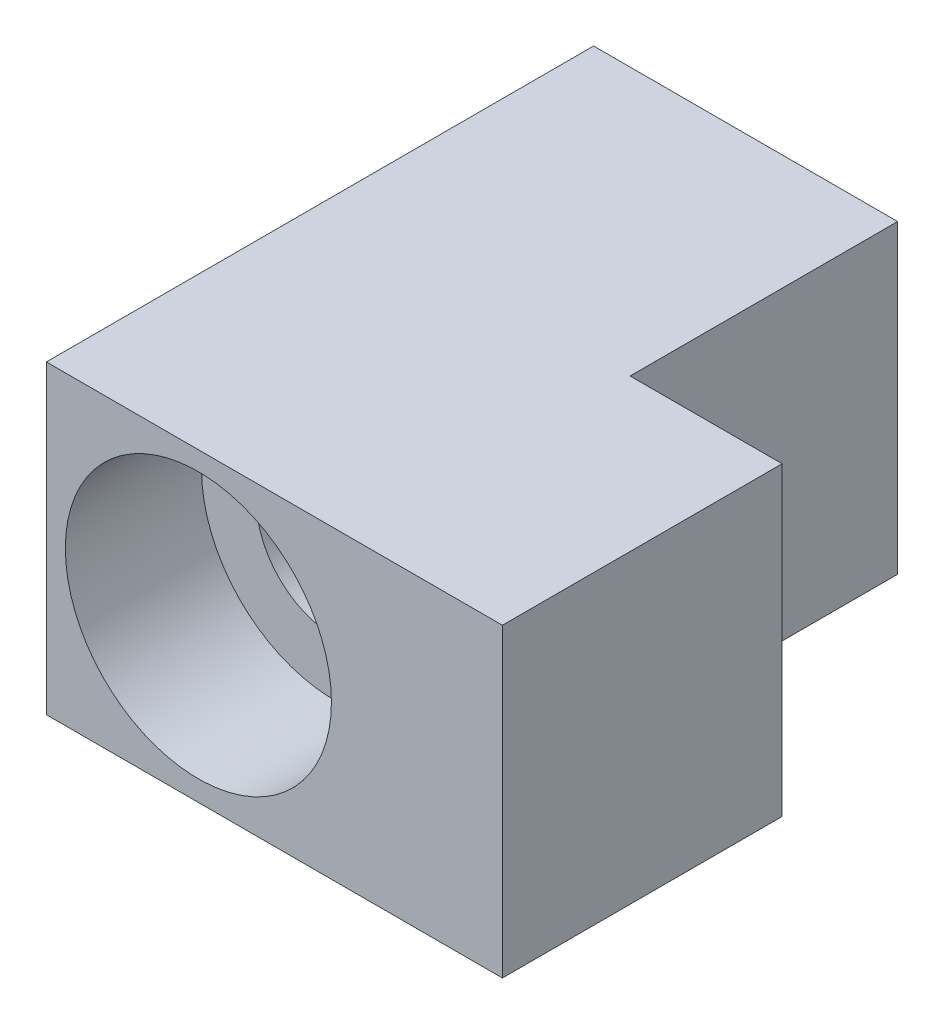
ISO-10303-21;
HEADER;
FILE_DESCRIPTION(('STEP AP214'),'2;1');
FILE_NAME('part.step','',(''),(''),'','','');
FILE_SCHEMA(('AUTOMOTIVE_DESIGN { 1 0 10303 214 1 1 1 1 }'));
ENDSEC;
DATA;
#1=APPLICATION_CONTEXT('core data for automotive mechanical design processes');
#2=APPLICATION_PROTOCOL_DEFINITION('international standard','automotive_design',2000,#1);
#3=PRODUCT_CONTEXT('',#1,'mechanical');
#4=PRODUCT('Part','Part','',(#3));
#5=PRODUCT_RELATED_PRODUCT_CATEGORY('part','',(#4));
#6=PRODUCT_DEFINITION_FORMATION('','',#4);
#7=PRODUCT_DEFINITION_CONTEXT('part definition',#1,'design');
#8=PRODUCT_DEFINITION('design','',#6,#7);
#9=PRODUCT_DEFINITION_SHAPE('','',#8);
#10=(LENGTH_UNIT() NAMED_UNIT(*) SI_UNIT(.MILLI.,.METRE.));
#11=(NAMED_UNIT(*) PLANE_ANGLE_UNIT() SI_UNIT($,.RADIAN.));
#12=(NAMED_UNIT(*) SI_UNIT($,.STERADIAN.) SOLID_ANGLE_UNIT());
#13=UNCERTAINTY_MEASURE_WITH_UNIT(LENGTH_MEASURE(1.E-05),#10,'distance_accuracy_value','');
#14=(GEOMETRIC_REPRESENTATION_CONTEXT(3) GLOBAL_UNCERTAINTY_ASSIGNED_CONTEXT((#13)) GLOBAL_UNIT_ASSIGNED_CONTEXT((#10,
#11,#12)) REPRESENTATION_CONTEXT('',''));
#15=CARTESIAN_POINT('',(0.,0.,0.));
#16=DIRECTION('',(0.,0.,1.));
#17=DIRECTION('',(1.,0.,0.));
#18=AXIS2_PLACEMENT_3D('',#15,#16,#17);
#19=CARTESIAN_POINT('',(6.35,0.,11.43));
#20=DIRECTION('',(-1.,0.,0.));
#21=DIRECTION('',(0.,0.,1.));
#22=AXIS2_PLACEMENT_3D('',#19,#20,#21);
#23=PLANE('',#22);
#24=DIRECTION('',(0.,1.,0.));
#25=VECTOR('',#24,1.);
#26=CARTESIAN_POINT('',(6.35,6.38112745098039,5.588));
#27=LINE('',#26,#25);
#28=CARTESIAN_POINT('',(6.35,0.,5.588));
#29=VERTEX_POINT('',#28);
#30=CARTESIAN_POINT('',(6.35,6.38112745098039,5.588));
#31=VERTEX_POINT('',#30);
#32=EDGE_CURVE('E51',#29,#31,#27,.T.);
#33=ORIENTED_EDGE('',*,*,#32,.F.);
#34=DIRECTION('',(0.,0.,-1.));
#35=VECTOR('',#34,1.);
#36=CARTESIAN_POINT('',(6.35,0.,11.43));
#37=LINE('',#36,#35);
#38=CARTESIAN_POINT('',(6.35,0.,0.));
#39=VERTEX_POINT('',#38);
#40=EDGE_CURVE('E43',#29,#39,#37,.T.);
#41=ORIENTED_EDGE('',*,*,#40,.T.);
#42=DIRECTION('',(0.,1.,0.));
#43=VECTOR('',#42,1.);
#44=CARTESIAN_POINT('',(6.35,0.,0.));
#45=LINE('',#44,#43);
#46=CARTESIAN_POINT('',(6.35,6.38112745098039,0.));
#47=VERTEX_POINT('',#46);
#48=EDGE_CURVE('E90',#39,#47,#45,.T.);
#49=ORIENTED_EDGE('',*,*,#48,.T.);
#50=DIRECTION('',(0.,0.,-1.));
#51=VECTOR('',#50,1.);
#52=CARTESIAN_POINT('',(6.35,6.38112745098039,11.43));
#53=LINE('',#52,#51);
#54=EDGE_CURVE('E84',#31,#47,#53,.T.);
#55=ORIENTED_EDGE('',*,*,#54,.F.);
#56=EDGE_LOOP('',(#33,#41,#49,#55));
#57=FACE_BOUND('',#56,.T.);
#58=ADVANCED_FACE('F34',(#57),#23,.F.);
#59=CARTESIAN_POINT('',(0.,0.,11.43));
#60=DIRECTION('',(1.,0.,0.));
#61=DIRECTION('',(0.,0.,-1.));
#62=AXIS2_PLACEMENT_3D('',#59,#60,#61);
#63=PLANE('',#62);
#64=DIRECTION('',(0.,-1.,0.));
#65=VECTOR('',#64,1.);
#66=CARTESIAN_POINT('',(0.,0.,0.));
#67=LINE('',#66,#65);
#68=CARTESIAN_POINT('',(0.,6.38112745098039,0.));
#69=VERTEX_POINT('',#68);
#70=CARTESIAN_POINT('',(0.,0.,0.));
#71=VERTEX_POINT('',#70);
#72=EDGE_CURVE('E95',#69,#71,#67,.T.);
#73=ORIENTED_EDGE('',*,*,#72,.T.);
#74=DIRECTION('',(0.,0.,-1.));
#75=VECTOR('',#74,1.);
#76=CARTESIAN_POINT('',(0.,0.,11.43));
#77=LINE('',#76,#75);
#78=CARTESIAN_POINT('',(0.,0.,11.43));
#79=VERTEX_POINT('',#78);
#80=EDGE_CURVE('E11',#79,#71,#77,.T.);
#81=ORIENTED_EDGE('',*,*,#80,.F.);
#82=DIRECTION('',(0.,-1.,0.));
#83=VECTOR('',#82,1.);
#84=CARTESIAN_POINT('',(0.,0.,11.43));
#85=LINE('',#84,#83);
#86=CARTESIAN_POINT('',(0.,6.38112745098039,11.43));
#87=VERTEX_POINT('',#86);
#88=EDGE_CURVE('E89',#87,#79,#85,.T.);
#89=ORIENTED_EDGE('',*,*,#88,.F.);
#90=DIRECTION('',(0.,0.,-1.));
#91=VECTOR('',#90,1.);
#92=CARTESIAN_POINT('',(0.,6.38112745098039,11.43));
#93=LINE('',#92,#91);
#94=EDGE_CURVE('E81',#87,#69,#93,.T.);
#95=ORIENTED_EDGE('',*,*,#94,.T.);
#96=EDGE_LOOP('',(#73,#81,#89,#95));
#97=FACE_BOUND('',#96,.T.);
#98=ADVANCED_FACE('F36',(#97),#63,.F.);
#99=CARTESIAN_POINT('',(0.,0.,11.43));
#100=DIRECTION('',(0.,1.,0.));
#101=DIRECTION('',(0.,0.,1.));
#102=AXIS2_PLACEMENT_3D('',#99,#100,#101);
#103=PLANE('',#102);
#104=DIRECTION('',(1.,0.,0.));
#105=VECTOR('',#104,1.);
#106=CARTESIAN_POINT('',(0.,0.,0.));
#107=LINE('',#106,#105);
#108=EDGE_CURVE('E99',#71,#39,#107,.T.);
#109=ORIENTED_EDGE('',*,*,#108,.T.);
#110=ORIENTED_EDGE('',*,*,#40,.F.);
#111=DIRECTION('',(-1.,0.,0.));
#112=VECTOR('',#111,1.);
#113=CARTESIAN_POINT('',(9.525,0.,5.588));
#114=LINE('',#113,#112);
#115=CARTESIAN_POINT('',(9.525,0.,5.588));
#116=VERTEX_POINT('',#115);
#117=EDGE_CURVE('E100',#116,#29,#114,.T.);
#118=ORIENTED_EDGE('',*,*,#117,.F.);
#119=DIRECTION('',(0.,0.,-1.));
#120=VECTOR('',#119,1.);
#121=CARTESIAN_POINT('',(9.525,0.,11.43));
#122=LINE('',#121,#120);
#123=CARTESIAN_POINT('',(9.525,0.,11.43));
#124=VERTEX_POINT('',#123);
#125=EDGE_CURVE('E137',#124,#116,#122,.T.);
#126=ORIENTED_EDGE('',*,*,#125,.F.);
#127=DIRECTION('',(1.,0.,0.));
#128=VECTOR('',#127,1.);
#129=CARTESIAN_POINT('',(0.,0.,11.43));
#130=LINE('',#129,#128);
#131=EDGE_CURVE('E125',#79,#124,#130,.T.);
#132=ORIENTED_EDGE('',*,*,#131,.F.);
#133=ORIENTED_EDGE('',*,*,#80,.T.);
#134=EDGE_LOOP('',(#109,#110,#118,#126,#132,#133));
#135=FACE_BOUND('',#134,.T.);
#136=ADVANCED_FACE('F138',(#135),#103,.F.);
#137=CARTESIAN_POINT('',(0.,6.38112745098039,11.43));
#138=DIRECTION('',(0.,-1.,0.));
#139=DIRECTION('',(0.,0.,-1.));
#140=AXIS2_PLACEMENT_3D('',#137,#138,#139);
#141=PLANE('',#140);
#142=DIRECTION('',(-1.,0.,0.));
#143=VECTOR('',#142,1.);
#144=CARTESIAN_POINT('',(0.,6.38112745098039,0.));
#145=LINE('',#144,#143);
#146=EDGE_CURVE('E78',#47,#69,#145,.T.);
#147=ORIENTED_EDGE('',*,*,#146,.T.);
#148=ORIENTED_EDGE('',*,*,#94,.F.);
#149=DIRECTION('',(-1.,0.,0.));
#150=VECTOR('',#149,1.);
#151=CARTESIAN_POINT('',(0.,6.38112745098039,11.43));
#152=LINE('',#151,#150);
#153=CARTESIAN_POINT('',(9.525,6.38112745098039,11.43));
#154=VERTEX_POINT('',#153);
#155=EDGE_CURVE('E60',#154,#87,#152,.T.);
#156=ORIENTED_EDGE('',*,*,#155,.F.);
#157=DIRECTION('',(0.,0.,1.));
#158=VECTOR('',#157,1.);
#159=CARTESIAN_POINT('',(9.525,6.38112745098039,11.43));
#160=LINE('',#159,#158);
#161=CARTESIAN_POINT('',(9.525,6.38112745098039,5.588));
#162=VERTEX_POINT('',#161);
#163=EDGE_CURVE('E123',#162,#154,#160,.T.);
#164=ORIENTED_EDGE('',*,*,#163,.F.);
#165=DIRECTION('',(-1.,0.,0.));
#166=VECTOR('',#165,1.);
#167=CARTESIAN_POINT('',(9.525,6.38112745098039,5.588));
#168=LINE('',#167,#166);
#169=EDGE_CURVE('E104',#162,#31,#168,.T.);
#170=ORIENTED_EDGE('',*,*,#169,.T.);
#171=ORIENTED_EDGE('',*,*,#54,.T.);
#172=EDGE_LOOP('',(#147,#148,#156,#164,#170,#171));
#173=FACE_BOUND('',#172,.T.);
#174=ADVANCED_FACE('F80',(#173),#141,.F.);
#175=CARTESIAN_POINT('',(0.,0.,11.43));
#176=DIRECTION('',(0.,0.,-1.));
#177=DIRECTION('',(-1.,0.,0.));
#178=AXIS2_PLACEMENT_3D('',#175,#176,#177);
#179=PLANE('',#178);
#180=CARTESIAN_POINT('',(3.175,3.20612745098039,11.43));
#181=DIRECTION('',(0.,0.,1.));
#182=DIRECTION('',(1.,0.,0.));
#183=AXIS2_PLACEMENT_3D('',#180,#181,#182);
#184=CIRCLE('',#183,2.77875999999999);
#185=CARTESIAN_POINT('',(5.95375999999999,3.20612745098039,11.43));
#186=VERTEX_POINT('',#185);
#187=EDGE_CURVE('E187',#186,#186,#184,.T.);
#188=ORIENTED_EDGE('',*,*,#187,.F.);
#189=EDGE_LOOP('',(#188));
#190=FACE_BOUND('',#189,.T.);
#191=ORIENTED_EDGE('',*,*,#88,.T.);
#192=ORIENTED_EDGE('',*,*,#131,.T.);
#193=DIRECTION('',(0.,-1.,0.));
#194=VECTOR('',#193,1.);
#195=CARTESIAN_POINT('',(9.525,6.38112745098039,11.43));
#196=LINE('',#195,#194);
#197=EDGE_CURVE('E118',#154,#124,#196,.T.);
#198=ORIENTED_EDGE('',*,*,#197,.F.);
#199=ORIENTED_EDGE('',*,*,#155,.T.);
#200=EDGE_LOOP('',(#191,#192,#198,#199));
#201=FACE_BOUND('',#200,.T.);
#202=ADVANCED_FACE('F129',(#190,#201),#179,.F.);
#203=CARTESIAN_POINT('',(0.,0.,0.));
#204=DIRECTION('',(0.,0.,-1.));
#205=DIRECTION('',(-1.,0.,0.));
#206=AXIS2_PLACEMENT_3D('',#203,#204,#205);
#207=PLANE('',#206);
#208=CARTESIAN_POINT('',(3.175,3.20612745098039,0.));
#209=DIRECTION('',(0.,0.,-1.));
#210=DIRECTION('',(-1.,0.,0.));
#211=AXIS2_PLACEMENT_3D('',#208,#209,#210);
#212=CIRCLE('',#211,1.63195);
#213=CARTESIAN_POINT('',(1.54304999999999,3.20612745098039,0.));
#214=VERTEX_POINT('',#213);
#215=EDGE_CURVE('E38',#214,#214,#212,.T.);
#216=ORIENTED_EDGE('',*,*,#215,.F.);
#217=EDGE_LOOP('',(#216));
#218=FACE_BOUND('',#217,.T.);
#219=ORIENTED_EDGE('',*,*,#72,.F.);
#220=ORIENTED_EDGE('',*,*,#146,.F.);
#221=ORIENTED_EDGE('',*,*,#48,.F.);
#222=ORIENTED_EDGE('',*,*,#108,.F.);
#223=EDGE_LOOP('',(#219,#220,#221,#222));
#224=FACE_BOUND('',#223,.T.);
#225=ADVANCED_FACE('F97',(#218,#224),#207,.T.);
#226=CARTESIAN_POINT('',(9.525,6.38112745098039,5.588));
#227=DIRECTION('',(0.,0.,1.));
#228=DIRECTION('',(0.,-1.,0.));
#229=AXIS2_PLACEMENT_3D('',#226,#227,#228);
#230=PLANE('',#229);
#231=ORIENTED_EDGE('',*,*,#32,.T.);
#232=ORIENTED_EDGE('',*,*,#169,.F.);
#233=DIRECTION('',(0.,1.,0.));
#234=VECTOR('',#233,1.);
#235=CARTESIAN_POINT('',(9.525,6.38112745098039,5.588));
#236=LINE('',#235,#234);
#237=EDGE_CURVE('E142',#116,#162,#236,.T.);
#238=ORIENTED_EDGE('',*,*,#237,.F.);
#239=ORIENTED_EDGE('',*,*,#117,.T.);
#240=EDGE_LOOP('',(#231,#232,#238,#239));
#241=FACE_BOUND('',#240,.T.);
#242=ADVANCED_FACE('F154',(#241),#230,.F.);
#243=CARTESIAN_POINT('',(9.525,0.,0.));
#244=DIRECTION('',(1.,0.,0.));
#245=DIRECTION('',(0.,0.,-1.));
#246=AXIS2_PLACEMENT_3D('',#243,#244,#245);
#247=PLANE('',#246);
#248=ORIENTED_EDGE('',*,*,#197,.T.);
#249=ORIENTED_EDGE('',*,*,#125,.T.);
#250=ORIENTED_EDGE('',*,*,#237,.T.);
#251=ORIENTED_EDGE('',*,*,#163,.T.);
#252=EDGE_LOOP('',(#248,#249,#250,#251));
#253=FACE_BOUND('',#252,.T.);
#254=ADVANCED_FACE('F145',(#253),#247,.T.);
#255=CARTESIAN_POINT('',(3.175,3.20612745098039,11.43));
#256=DIRECTION('',(0.,0.,1.));
#257=DIRECTION('',(1.,0.,0.));
#258=AXIS2_PLACEMENT_3D('',#255,#256,#257);
#259=CYLINDRICAL_SURFACE('',#258,1.63195);
#260=ORIENTED_EDGE('',*,*,#215,.T.);
#261=EDGE_LOOP('',(#260));
#262=FACE_BOUND('',#261,.T.);
#263=CARTESIAN_POINT('',(3.175,3.20612745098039,8.5852));
#264=DIRECTION('',(0.,0.,1.));
#265=DIRECTION('',(1.,0.,0.));
#266=AXIS2_PLACEMENT_3D('',#263,#264,#265);
#267=CIRCLE('',#266,1.63195000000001);
#268=CARTESIAN_POINT('',(4.80695000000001,3.20612745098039,8.5852));
#269=VERTEX_POINT('',#268);
#270=EDGE_CURVE('E149',#269,#269,#267,.T.);
#271=ORIENTED_EDGE('',*,*,#270,.T.);
#272=EDGE_LOOP('',(#271));
#273=FACE_BOUND('',#272,.T.);
#274=ADVANCED_FACE('F164',(#262,#273),#259,.F.);
#275=CARTESIAN_POINT('',(4.80695000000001,3.20612745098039,8.5852));
#276=DIRECTION('',(0.,0.,-1.));
#277=DIRECTION('',(-1.,0.,0.));
#278=AXIS2_PLACEMENT_3D('',#275,#276,#277);
#279=PLANE('',#278);
#280=ORIENTED_EDGE('',*,*,#270,.F.);
#281=EDGE_LOOP('',(#280));
#282=FACE_BOUND('',#281,.T.);
#283=CARTESIAN_POINT('',(3.175,3.20612745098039,8.5852));
#284=DIRECTION('',(0.,0.,1.));
#285=DIRECTION('',(1.,0.,0.));
#286=AXIS2_PLACEMENT_3D('',#283,#284,#285);
#287=CIRCLE('',#286,2.77875999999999);
#288=CARTESIAN_POINT('',(5.95375999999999,3.20612745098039,8.5852));
#289=VERTEX_POINT('',#288);
#290=EDGE_CURVE('E189',#289,#289,#287,.T.);
#291=ORIENTED_EDGE('',*,*,#290,.T.);
#292=EDGE_LOOP('',(#291));
#293=FACE_BOUND('',#292,.T.);
#294=ADVANCED_FACE('F201',(#282,#293),#279,.F.);
#295=CARTESIAN_POINT('',(3.175,3.20612745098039,11.43));
#296=DIRECTION('',(0.,0.,1.));
#297=DIRECTION('',(1.,0.,0.));
#298=AXIS2_PLACEMENT_3D('',#295,#296,#297);
#299=CYLINDRICAL_SURFACE('',#298,2.77875999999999);
#300=ORIENTED_EDGE('',*,*,#290,.F.);
#301=EDGE_LOOP('',(#300));
#302=FACE_BOUND('',#301,.T.);
#303=ORIENTED_EDGE('',*,*,#187,.T.);
#304=EDGE_LOOP('',(#303));
#305=FACE_BOUND('',#304,.T.);
#306=ADVANCED_FACE('F206',(#302,#305),#299,.F.);
#307=CLOSED_SHELL('',(#58,#98,#136,#174,#202,#225,#242,#254,#274,#294,#306));
#308=MANIFOLD_SOLID_BREP('B2',#307);
#309=ADVANCED_BREP_SHAPE_REPRESENTATION('',(#18,#308),#14);
#310=SHAPE_DEFINITION_REPRESENTATION(#9,#309);
ENDSEC;
END-ISO-10303-21;
